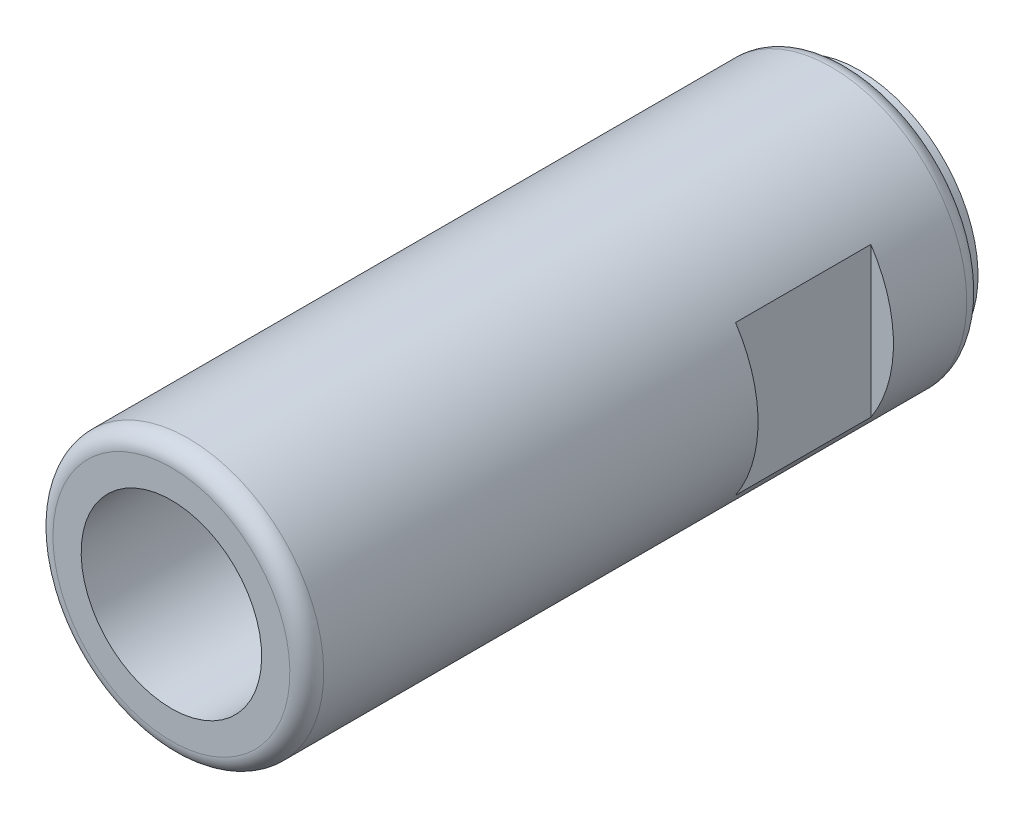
ISO-10303-21;
HEADER;
FILE_DESCRIPTION(('STEP AP214'),'2;1');
FILE_NAME('part.step','',(''),(''),'','','');
FILE_SCHEMA(('AUTOMOTIVE_DESIGN { 1 0 10303 214 1 1 1 1 }'));
ENDSEC;
DATA;
#1=APPLICATION_CONTEXT('core data for automotive mechanical design processes');
#2=APPLICATION_PROTOCOL_DEFINITION('international standard','automotive_design',2000,#1);
#3=PRODUCT_CONTEXT('',#1,'mechanical');
#4=PRODUCT('Part','Part','',(#3));
#5=PRODUCT_RELATED_PRODUCT_CATEGORY('part','',(#4));
#6=PRODUCT_DEFINITION_FORMATION('','',#4);
#7=PRODUCT_DEFINITION_CONTEXT('part definition',#1,'design');
#8=PRODUCT_DEFINITION('design','',#6,#7);
#9=PRODUCT_DEFINITION_SHAPE('','',#8);
#10=(LENGTH_UNIT() NAMED_UNIT(*) SI_UNIT(.MILLI.,.METRE.));
#11=(NAMED_UNIT(*) PLANE_ANGLE_UNIT() SI_UNIT($,.RADIAN.));
#12=(NAMED_UNIT(*) SI_UNIT($,.STERADIAN.) SOLID_ANGLE_UNIT());
#13=UNCERTAINTY_MEASURE_WITH_UNIT(LENGTH_MEASURE(1.E-05),#10,'distance_accuracy_value','');
#14=(GEOMETRIC_REPRESENTATION_CONTEXT(3) GLOBAL_UNCERTAINTY_ASSIGNED_CONTEXT((#13)) GLOBAL_UNIT_ASSIGNED_CONTEXT((#10,
#11,#12)) REPRESENTATION_CONTEXT('',''));
#15=CARTESIAN_POINT('',(0.,0.,0.));
#16=DIRECTION('',(0.,0.,1.));
#17=DIRECTION('',(1.,0.,0.));
#18=AXIS2_PLACEMENT_3D('',#15,#16,#17);
#19=CARTESIAN_POINT('',(0.,0.,0.));
#20=DIRECTION('',(0.,0.,1.));
#21=DIRECTION('',(0.,-1.,0.));
#22=AXIS2_PLACEMENT_3D('',#19,#20,#21);
#23=CYLINDRICAL_SURFACE('',#22,10.5);
#24=CARTESIAN_POINT('',(0.,0.,0.));
#25=DIRECTION('',(0.,0.,-1.));
#26=DIRECTION('',(0.,1.,0.));
#27=AXIS2_PLACEMENT_3D('',#24,#25,#26);
#28=CIRCLE('',#27,10.5);
#29=CARTESIAN_POINT('',(0.,10.5,0.));
#30=VERTEX_POINT('',#29);
#31=EDGE_CURVE('E92',#30,#30,#28,.T.);
#32=ORIENTED_EDGE('',*,*,#31,.F.);
#33=EDGE_LOOP('',(#32));
#34=FACE_BOUND('',#33,.T.);
#35=CARTESIAN_POINT('',(0.,0.,1.));
#36=DIRECTION('',(0.,0.,-1.));
#37=DIRECTION('',(0.,1.,0.));
#38=AXIS2_PLACEMENT_3D('',#35,#36,#37);
#39=CIRCLE('',#38,10.5);
#40=CARTESIAN_POINT('',(0.,10.5,1.));
#41=VERTEX_POINT('',#40);
#42=EDGE_CURVE('E78',#41,#41,#39,.T.);
#43=ORIENTED_EDGE('',*,*,#42,.T.);
#44=EDGE_LOOP('',(#43));
#45=FACE_BOUND('',#44,.T.);
#46=ADVANCED_FACE('F14',(#34,#45),#23,.T.);
#47=CARTESIAN_POINT('',(0.,0.,0.));
#48=DIRECTION('',(0.,0.,-1.));
#49=DIRECTION('',(0.,1.,0.));
#50=AXIS2_PLACEMENT_3D('',#47,#48,#49);
#51=PLANE('',#50);
#52=CARTESIAN_POINT('',(0.,0.,0.));
#53=DIRECTION('',(0.,0.,1.));
#54=DIRECTION('',(0.,-1.,0.));
#55=AXIS2_PLACEMENT_3D('',#52,#53,#54);
#56=CIRCLE('',#55,8.);
#57=CARTESIAN_POINT('',(0.,-8.,0.));
#58=VERTEX_POINT('',#57);
#59=EDGE_CURVE('E101',#58,#58,#56,.T.);
#60=ORIENTED_EDGE('',*,*,#59,.T.);
#61=EDGE_LOOP('',(#60));
#62=FACE_BOUND('',#61,.T.);
#63=ORIENTED_EDGE('',*,*,#31,.T.);
#64=EDGE_LOOP('',(#63));
#65=FACE_BOUND('',#64,.T.);
#66=ADVANCED_FACE('F105',(#62,#65),#51,.T.);
#67=CARTESIAN_POINT('',(10.5,0.,61.));
#68=DIRECTION('',(0.,0.,1.));
#69=DIRECTION('',(0.,-1.,0.));
#70=AXIS2_PLACEMENT_3D('',#67,#68,#69);
#71=PLANE('',#70);
#72=CARTESIAN_POINT('',(0.,0.,61.));
#73=DIRECTION('',(0.,0.,1.));
#74=DIRECTION('',(0.,-1.,0.));
#75=AXIS2_PLACEMENT_3D('',#72,#73,#74);
#76=CIRCLE('',#75,8.);
#77=CARTESIAN_POINT('',(0.,-8.,61.));
#78=VERTEX_POINT('',#77);
#79=EDGE_CURVE('E98',#78,#78,#76,.T.);
#80=ORIENTED_EDGE('',*,*,#79,.F.);
#81=EDGE_LOOP('',(#80));
#82=FACE_BOUND('',#81,.T.);
#83=CARTESIAN_POINT('',(0.,0.,61.));
#84=DIRECTION('',(0.,0.,-1.));
#85=DIRECTION('',(0.,1.,0.));
#86=AXIS2_PLACEMENT_3D('',#83,#84,#85);
#87=CIRCLE('',#86,10.5);
#88=CARTESIAN_POINT('',(0.,10.5,61.));
#89=VERTEX_POINT('',#88);
#90=EDGE_CURVE('E87',#89,#89,#87,.T.);
#91=ORIENTED_EDGE('',*,*,#90,.F.);
#92=EDGE_LOOP('',(#91));
#93=FACE_BOUND('',#92,.T.);
#94=ADVANCED_FACE('F16',(#82,#93),#71,.T.);
#95=CARTESIAN_POINT('',(0.,0.,9.));
#96=DIRECTION('',(0.,0.,1.));
#97=DIRECTION('',(0.,-1.,0.));
#98=AXIS2_PLACEMENT_3D('',#95,#96,#97);
#99=PLANE('',#98);
#100=DIRECTION('',(0.,-1.,0.));
#101=VECTOR('',#100,1.);
#102=CARTESIAN_POINT('',(-10.,24.,9.));
#103=LINE('',#102,#101);
#104=CARTESIAN_POINT('',(-10.,6.6332495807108,9.));
#105=VERTEX_POINT('',#104);
#106=CARTESIAN_POINT('',(-10.,-6.6332495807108,9.));
#107=VERTEX_POINT('',#106);
#108=EDGE_CURVE('E30',#105,#107,#103,.T.);
#109=ORIENTED_EDGE('',*,*,#108,.F.);
#110=CARTESIAN_POINT('',(0.,0.,9.));
#111=DIRECTION('',(0.,0.,1.));
#112=DIRECTION('',(0.,-1.,0.));
#113=AXIS2_PLACEMENT_3D('',#110,#111,#112);
#114=CIRCLE('',#113,12.);
#115=EDGE_CURVE('E54',#107,#105,#114,.F.);
#116=ORIENTED_EDGE('',*,*,#115,.F.);
#117=EDGE_LOOP('',(#109,#116));
#118=FACE_BOUND('',#117,.T.);
#119=ADVANCED_FACE('F55',(#118),#99,.T.);
#120=CARTESIAN_POINT('',(-10.,24.,21.));
#121=DIRECTION('',(1.,0.,0.));
#122=DIRECTION('',(0.,1.,0.));
#123=AXIS2_PLACEMENT_3D('',#120,#121,#122);
#124=PLANE('',#123);
#125=DIRECTION('',(0.,0.,-1.));
#126=VECTOR('',#125,1.);
#127=CARTESIAN_POINT('',(-10.,-6.6332495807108,1.));
#128=LINE('',#127,#126);
#129=CARTESIAN_POINT('',(-10.,-6.6332495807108,21.));
#130=VERTEX_POINT('',#129);
#131=EDGE_CURVE('E18',#107,#130,#128,.F.);
#132=ORIENTED_EDGE('',*,*,#131,.T.);
#133=DIRECTION('',(0.,-1.,0.));
#134=VECTOR('',#133,1.);
#135=CARTESIAN_POINT('',(-10.,24.,21.));
#136=LINE('',#135,#134);
#137=CARTESIAN_POINT('',(-10.,6.6332495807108,21.));
#138=VERTEX_POINT('',#137);
#139=EDGE_CURVE('E89',#138,#130,#136,.T.);
#140=ORIENTED_EDGE('',*,*,#139,.F.);
#141=DIRECTION('',(0.,0.,-1.));
#142=VECTOR('',#141,1.);
#143=CARTESIAN_POINT('',(-10.,6.6332495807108,1.));
#144=LINE('',#143,#142);
#145=EDGE_CURVE('E59',#138,#105,#144,.T.);
#146=ORIENTED_EDGE('',*,*,#145,.T.);
#147=ORIENTED_EDGE('',*,*,#108,.T.);
#148=EDGE_LOOP('',(#132,#140,#146,#147));
#149=FACE_BOUND('',#148,.T.);
#150=ADVANCED_FACE('F63',(#149),#124,.F.);
#151=CARTESIAN_POINT('',(0.,0.,21.));
#152=DIRECTION('',(0.,0.,1.));
#153=DIRECTION('',(0.,-1.,0.));
#154=AXIS2_PLACEMENT_3D('',#151,#152,#153);
#155=PLANE('',#154);
#156=CARTESIAN_POINT('',(0.,0.,21.));
#157=DIRECTION('',(0.,0.,1.));
#158=DIRECTION('',(0.,-1.,0.));
#159=AXIS2_PLACEMENT_3D('',#156,#157,#158);
#160=CIRCLE('',#159,12.);
#161=EDGE_CURVE('E9',#130,#138,#160,.F.);
#162=ORIENTED_EDGE('',*,*,#161,.T.);
#163=ORIENTED_EDGE('',*,*,#139,.T.);
#164=EDGE_LOOP('',(#162,#163));
#165=FACE_BOUND('',#164,.T.);
#166=ADVANCED_FACE('F134',(#165),#155,.F.);
#167=DIRECTION('',(0.,1.,0.));
#168=VECTOR('',#167,1.);
#169=CARTESIAN_POINT('',(10.,-24.,21.));
#170=LINE('',#169,#168);
#171=CARTESIAN_POINT('',(10.,-6.6332495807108,21.));
#172=VERTEX_POINT('',#171);
#173=CARTESIAN_POINT('',(10.,6.6332495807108,21.));
#174=VERTEX_POINT('',#173);
#175=EDGE_CURVE('E66',#172,#174,#170,.T.);
#176=ORIENTED_EDGE('',*,*,#175,.T.);
#177=EDGE_CURVE('E24',#174,#172,#160,.F.);
#178=ORIENTED_EDGE('',*,*,#177,.T.);
#179=EDGE_LOOP('',(#176,#178));
#180=FACE_BOUND('',#179,.T.);
#181=ADVANCED_FACE('F130',(#180),#155,.F.);
#182=DIRECTION('',(0.,1.,0.));
#183=VECTOR('',#182,1.);
#184=CARTESIAN_POINT('',(10.,-24.,9.));
#185=LINE('',#184,#183);
#186=CARTESIAN_POINT('',(10.,-6.6332495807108,9.));
#187=VERTEX_POINT('',#186);
#188=CARTESIAN_POINT('',(10.,6.6332495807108,9.));
#189=VERTEX_POINT('',#188);
#190=EDGE_CURVE('E37',#187,#189,#185,.T.);
#191=ORIENTED_EDGE('',*,*,#190,.F.);
#192=EDGE_CURVE('E61',#189,#187,#114,.F.);
#193=ORIENTED_EDGE('',*,*,#192,.F.);
#194=EDGE_LOOP('',(#191,#193));
#195=FACE_BOUND('',#194,.T.);
#196=ADVANCED_FACE('F133',(#195),#99,.T.);
#197=CARTESIAN_POINT('',(10.,-24.,21.));
#198=DIRECTION('',(-1.,0.,0.));
#199=DIRECTION('',(0.,-1.,0.));
#200=AXIS2_PLACEMENT_3D('',#197,#198,#199);
#201=PLANE('',#200);
#202=DIRECTION('',(0.,0.,-1.));
#203=VECTOR('',#202,1.);
#204=CARTESIAN_POINT('',(10.,6.6332495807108,1.));
#205=LINE('',#204,#203);
#206=EDGE_CURVE('E72',#189,#174,#205,.F.);
#207=ORIENTED_EDGE('',*,*,#206,.T.);
#208=ORIENTED_EDGE('',*,*,#175,.F.);
#209=DIRECTION('',(0.,0.,-1.));
#210=VECTOR('',#209,1.);
#211=CARTESIAN_POINT('',(10.,-6.6332495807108,1.));
#212=LINE('',#211,#210);
#213=EDGE_CURVE('E75',#172,#187,#212,.T.);
#214=ORIENTED_EDGE('',*,*,#213,.T.);
#215=ORIENTED_EDGE('',*,*,#190,.T.);
#216=EDGE_LOOP('',(#207,#208,#214,#215));
#217=FACE_BOUND('',#216,.T.);
#218=ADVANCED_FACE('F138',(#217),#201,.F.);
#219=CARTESIAN_POINT('',(0.,0.,59.5));
#220=DIRECTION('',(0.,0.,-1.));
#221=DIRECTION('',(0.,1.,0.));
#222=AXIS2_PLACEMENT_3D('',#219,#220,#221);
#223=TOROIDAL_SURFACE('',#222,10.5,1.5);
#224=ORIENTED_EDGE('',*,*,#90,.T.);
#225=EDGE_LOOP('',(#224));
#226=FACE_BOUND('',#225,.T.);
#227=CARTESIAN_POINT('',(0.,0.,59.5));
#228=DIRECTION('',(0.,0.,-1.));
#229=DIRECTION('',(0.,1.,0.));
#230=AXIS2_PLACEMENT_3D('',#227,#228,#229);
#231=CIRCLE('',#230,12.);
#232=CARTESIAN_POINT('',(0.,12.,59.5));
#233=VERTEX_POINT('',#232);
#234=EDGE_CURVE('E84',#233,#233,#231,.T.);
#235=ORIENTED_EDGE('',*,*,#234,.F.);
#236=EDGE_LOOP('',(#235));
#237=FACE_BOUND('',#236,.T.);
#238=ADVANCED_FACE('F143',(#226,#237),#223,.T.);
#239=CARTESIAN_POINT('',(0.,0.,1.));
#240=DIRECTION('',(0.,0.,-1.));
#241=DIRECTION('',(0.,1.,0.));
#242=AXIS2_PLACEMENT_3D('',#239,#240,#241);
#243=CYLINDRICAL_SURFACE('',#242,12.);
#244=ORIENTED_EDGE('',*,*,#234,.T.);
#245=EDGE_LOOP('',(#244));
#246=FACE_BOUND('',#245,.T.);
#247=ORIENTED_EDGE('',*,*,#206,.F.);
#248=ORIENTED_EDGE('',*,*,#192,.T.);
#249=ORIENTED_EDGE('',*,*,#213,.F.);
#250=ORIENTED_EDGE('',*,*,#177,.F.);
#251=EDGE_LOOP('',(#247,#248,#249,#250));
#252=FACE_BOUND('',#251,.T.);
#253=ORIENTED_EDGE('',*,*,#161,.F.);
#254=ORIENTED_EDGE('',*,*,#131,.F.);
#255=ORIENTED_EDGE('',*,*,#115,.T.);
#256=ORIENTED_EDGE('',*,*,#145,.F.);
#257=EDGE_LOOP('',(#253,#254,#255,#256));
#258=FACE_BOUND('',#257,.T.);
#259=CARTESIAN_POINT('',(0.,0.,2.5));
#260=DIRECTION('',(0.,0.,-1.));
#261=DIRECTION('',(0.,1.,0.));
#262=AXIS2_PLACEMENT_3D('',#259,#260,#261);
#263=CIRCLE('',#262,12.);
#264=CARTESIAN_POINT('',(0.,12.,2.5));
#265=VERTEX_POINT('',#264);
#266=EDGE_CURVE('E81',#265,#265,#263,.T.);
#267=ORIENTED_EDGE('',*,*,#266,.F.);
#268=EDGE_LOOP('',(#267));
#269=FACE_BOUND('',#268,.T.);
#270=ADVANCED_FACE('F69',(#246,#252,#258,#269),#243,.T.);
#271=CARTESIAN_POINT('',(0.,0.,2.5));
#272=DIRECTION('',(0.,0.,-1.));
#273=DIRECTION('',(0.,1.,0.));
#274=AXIS2_PLACEMENT_3D('',#271,#272,#273);
#275=TOROIDAL_SURFACE('',#274,10.5,1.5);
#276=ORIENTED_EDGE('',*,*,#266,.T.);
#277=EDGE_LOOP('',(#276));
#278=FACE_BOUND('',#277,.T.);
#279=ORIENTED_EDGE('',*,*,#42,.F.);
#280=EDGE_LOOP('',(#279));
#281=FACE_BOUND('',#280,.T.);
#282=ADVANCED_FACE('F110',(#278,#281),#275,.T.);
#283=CARTESIAN_POINT('',(0.,0.,0.));
#284=DIRECTION('',(0.,0.,1.));
#285=DIRECTION('',(0.,-1.,0.));
#286=AXIS2_PLACEMENT_3D('',#283,#284,#285);
#287=CYLINDRICAL_SURFACE('',#286,8.);
#288=ORIENTED_EDGE('',*,*,#79,.T.);
#289=EDGE_LOOP('',(#288));
#290=FACE_BOUND('',#289,.T.);
#291=ORIENTED_EDGE('',*,*,#59,.F.);
#292=EDGE_LOOP('',(#291));
#293=FACE_BOUND('',#292,.T.);
#294=ADVANCED_FACE('F108',(#290,#293),#287,.F.);
#295=CLOSED_SHELL('',(#46,#66,#94,#119,#150,#166,#181,#196,#218,#238,#270,#282,#294));
#296=MANIFOLD_SOLID_BREP('B1',#295);
#297=ADVANCED_BREP_SHAPE_REPRESENTATION('',(#18,#296),#14);
#298=SHAPE_DEFINITION_REPRESENTATION(#9,#297);
ENDSEC;
END-ISO-10303-21;
